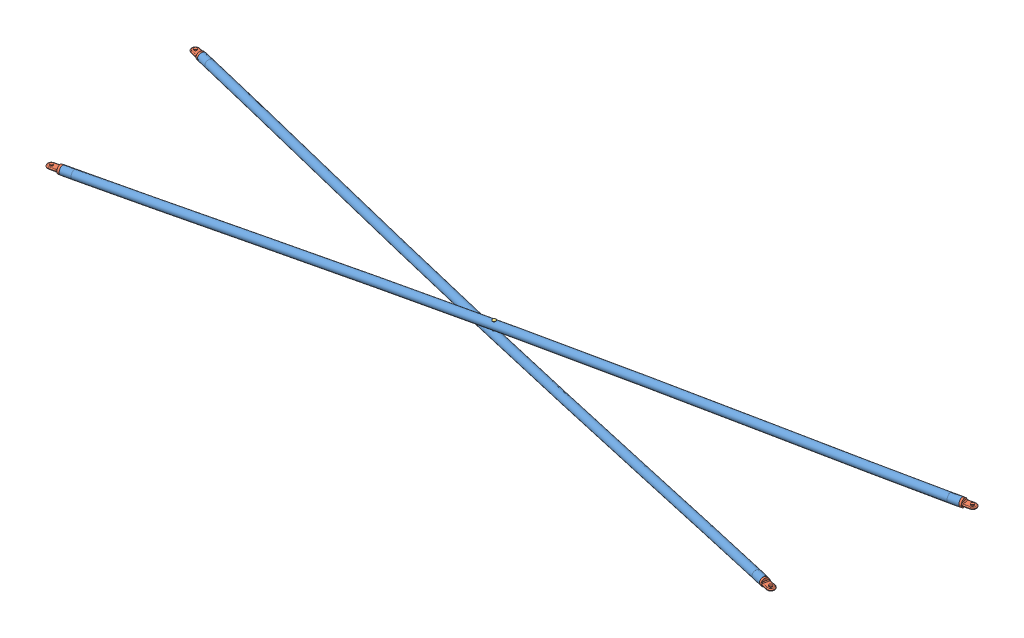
SolidWorks assembly Stangenkreuz_780H.SLDASM, configuration Standard (file format 5000). Lengths in mm.
Overall size (797.31 18.46 187.81).
9 component instances, 3 part files, 3 mates.
Components (placement in the parent):
- Stange+Gelenk_780-365-2: Stange+Gelenk_780-365.sldasm [Standard] at (-14.6012 -4 -3.4359) x (0 -1 0) z (0.229057 0 -0.973413) size (12.13 785.91 8)
  - Stange-1: Stange.SLDPRT [760x8mm-B365] at (-4 -380 0) size (12.13 760 8)
  - Endstift-1: Endstift.SLDPRT [Standard] at (-4 380 0) size (7.8 22.96 7.8)
  - Endstift-2: Endstift.SLDPRT [Standard] at (-4 -380 0) x (1 0 0) z (0 0 -1) size (7.8 22.96 7.8)
- Stange+Gelenk_780-365-3: Stange+Gelenk_780-365.sldasm [Standard] at (14.6493 4 -3.2246) x (0 1 0) z (-0.214976 0 -0.976619) size (12.13 785.91 8)
  - Stange-1: Stange.SLDPRT [760x8mm-B365] at (-4 -380 0) size (12.13 760 8)
  - Endstift-1: Endstift.SLDPRT [Standard] at (-4 380 0) size (7.8 22.96 7.8)
  - Endstift-2: Endstift.SLDPRT [Standard] at (-4 -380 0) x (1 0 0) z (0 0 -1) size (7.8 22.96 7.8)
- rivet 02_din-2: rivet 02_din.sldprt [DIN 660-2x16-St-A-16,06] at (0 -8.03 0) x (0 -1 0) z (0 0 1) size (18.46 3.5 3.5)
Mates (geometry in assembly coordinates):
- Deckungsgleich1: coincident anti-aligned: circle of Stange+Gelenk_780-365-2/Stange-1; circle of Stange+Gelenk_780-365-3/Stange-1
- Konzentrisch1: concentric anti-aligned: cylinder of Stange+Gelenk_780-365-3/Stange-1 through (0 8.03 0) axis (0 -1 0) radius 1; cylinder of rivet 02_din-2 through (0 30.97 0) axis (0 1 0) radius 1
- Deckungsgleich2: coincident anti-aligned: plane of Stange+Gelenk_780-365-3/Stange-1 through (0 8.03 0) normal (0 1 0); plane of rivet 02_din-2 through (1 8.03 0) normal (0 -1 0)
